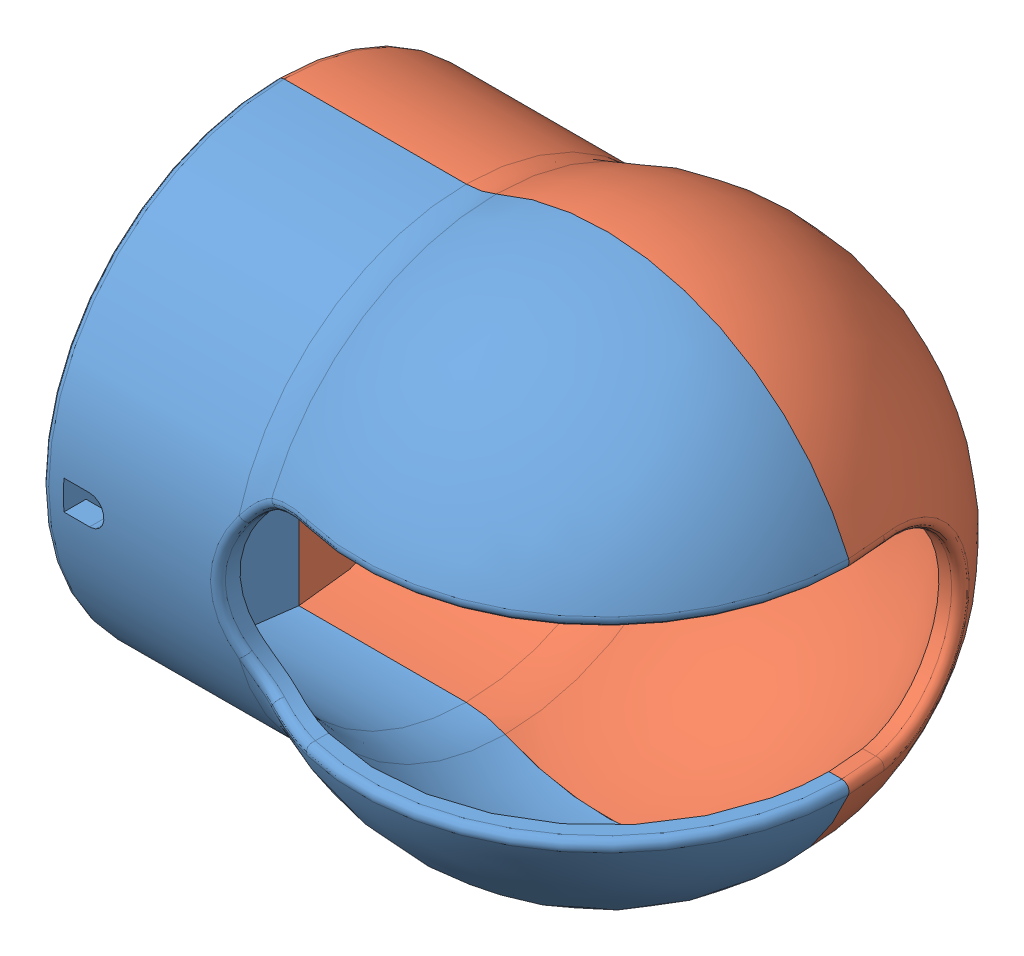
SolidWorks assembly SE-Coques.SLDASM, configuration Défaut (file format 3100). Lengths in mm.
Overall size (78.12 72 69.29).
2 component instances, 2 part files, 3 mates.
Components (placement in the parent):
- Coque avant-1: Coque avant.SLDPRT [Défaut] at origin size (77.79 72 33.29)
- Coque arriere-1: Coque arriere.SLDPRT [Défaut] x (1 0 0) z (0 0 -1) size (78.12 72 36)
Mates (geometry in assembly coordinates):
- Coaxiale1: concentric aligned: cylinder of Coque avant-1; cylinder of Coque arriere-1
- Coïncidente1: coincident aligned: plane of Coque avant-1 through (-44.5 0 0) normal (-1 0 0); plane of Coque arriere-1 through (-44.5 0 0) normal (-1 0 0)
- Coïncidente2: coincident anti-aligned: plane of Coque avant-1 through (0 0 0) normal (0 0 -1); plane of Coque arriere-1 through (0 0 0) normal (0 0 1)
